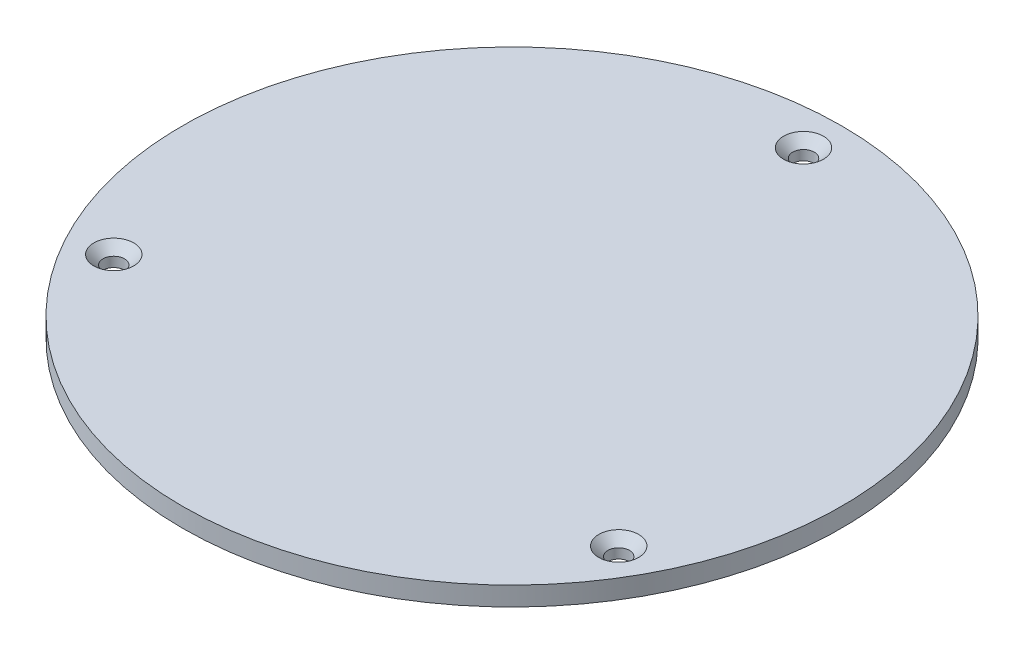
ISO-10303-21;
HEADER;
FILE_DESCRIPTION(('STEP AP214'),'2;1');
FILE_NAME('part.step','',(''),(''),'','','');
FILE_SCHEMA(('AUTOMOTIVE_DESIGN { 1 0 10303 214 1 1 1 1 }'));
ENDSEC;
DATA;
#1=APPLICATION_CONTEXT('core data for automotive mechanical design processes');
#2=APPLICATION_PROTOCOL_DEFINITION('international standard','automotive_design',2000,#1);
#3=PRODUCT_CONTEXT('',#1,'mechanical');
#4=PRODUCT('Part','Part','',(#3));
#5=PRODUCT_RELATED_PRODUCT_CATEGORY('part','',(#4));
#6=PRODUCT_DEFINITION_FORMATION('','',#4);
#7=PRODUCT_DEFINITION_CONTEXT('part definition',#1,'design');
#8=PRODUCT_DEFINITION('design','',#6,#7);
#9=PRODUCT_DEFINITION_SHAPE('','',#8);
#10=(LENGTH_UNIT() NAMED_UNIT(*) SI_UNIT(.MILLI.,.METRE.));
#11=(NAMED_UNIT(*) PLANE_ANGLE_UNIT() SI_UNIT($,.RADIAN.));
#12=(NAMED_UNIT(*) SI_UNIT($,.STERADIAN.) SOLID_ANGLE_UNIT());
#13=UNCERTAINTY_MEASURE_WITH_UNIT(LENGTH_MEASURE(1.E-05),#10,'distance_accuracy_value','');
#14=(GEOMETRIC_REPRESENTATION_CONTEXT(3) GLOBAL_UNCERTAINTY_ASSIGNED_CONTEXT((#13)) GLOBAL_UNIT_ASSIGNED_CONTEXT((#10,
#11,#12)) REPRESENTATION_CONTEXT('',''));
#15=CARTESIAN_POINT('',(0.,0.,0.));
#16=DIRECTION('',(0.,0.,1.));
#17=DIRECTION('',(1.,0.,0.));
#18=AXIS2_PLACEMENT_3D('',#15,#16,#17);
#19=CARTESIAN_POINT('',(0.,3.,0.));
#20=DIRECTION('',(0.,-1.,0.));
#21=DIRECTION('',(0.,0.,-1.));
#22=AXIS2_PLACEMENT_3D('',#19,#20,#21);
#23=CYLINDRICAL_SURFACE('',#22,52.);
#24=CARTESIAN_POINT('',(0.,3.,0.));
#25=DIRECTION('',(0.,1.,0.));
#26=DIRECTION('',(0.,0.,1.));
#27=AXIS2_PLACEMENT_3D('',#24,#25,#26);
#28=CIRCLE('',#27,52.);
#29=CARTESIAN_POINT('',(0.,3.,52.));
#30=VERTEX_POINT('',#29);
#31=EDGE_CURVE('E12',#30,#30,#28,.T.);
#32=ORIENTED_EDGE('',*,*,#31,.F.);
#33=EDGE_LOOP('',(#32));
#34=FACE_BOUND('',#33,.T.);
#35=CARTESIAN_POINT('',(0.,0.,0.));
#36=DIRECTION('',(0.,1.,0.));
#37=DIRECTION('',(0.,0.,1.));
#38=AXIS2_PLACEMENT_3D('',#35,#36,#37);
#39=CIRCLE('',#38,52.);
#40=CARTESIAN_POINT('',(0.,0.,52.));
#41=VERTEX_POINT('',#40);
#42=EDGE_CURVE('E43',#41,#41,#39,.T.);
#43=ORIENTED_EDGE('',*,*,#42,.T.);
#44=EDGE_LOOP('',(#43));
#45=FACE_BOUND('',#44,.T.);
#46=ADVANCED_FACE('F40',(#34,#45),#23,.T.);
#47=CARTESIAN_POINT('',(0.,3.,0.));
#48=DIRECTION('',(0.,1.,0.));
#49=DIRECTION('',(0.,0.,1.));
#50=AXIS2_PLACEMENT_3D('',#47,#48,#49);
#51=PLANE('',#50);
#52=CARTESIAN_POINT('',(-39.8371685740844,3.,22.9999999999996));
#53=DIRECTION('',(0.,1.,0.));
#54=DIRECTION('',(0.,0.,1.));
#55=AXIS2_PLACEMENT_3D('',#52,#53,#54);
#56=CIRCLE('',#55,3.15);
#57=CARTESIAN_POINT('',(-39.8371685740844,3.,26.1499999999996));
#58=VERTEX_POINT('',#57);
#59=EDGE_CURVE('E75',#58,#58,#56,.T.);
#60=ORIENTED_EDGE('',*,*,#59,.F.);
#61=EDGE_LOOP('',(#60));
#62=FACE_BOUND('',#61,.T.);
#63=CARTESIAN_POINT('',(39.8371685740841,3.,23.0000000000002));
#64=DIRECTION('',(0.,1.,0.));
#65=DIRECTION('',(0.,0.,1.));
#66=AXIS2_PLACEMENT_3D('',#63,#64,#65);
#67=CIRCLE('',#66,3.15);
#68=CARTESIAN_POINT('',(39.8371685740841,3.,26.1500000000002));
#69=VERTEX_POINT('',#68);
#70=EDGE_CURVE('E66',#69,#69,#67,.T.);
#71=ORIENTED_EDGE('',*,*,#70,.F.);
#72=EDGE_LOOP('',(#71));
#73=FACE_BOUND('',#72,.T.);
#74=CARTESIAN_POINT('',(0.,3.,-46.));
#75=DIRECTION('',(0.,1.,0.));
#76=DIRECTION('',(0.,0.,1.));
#77=AXIS2_PLACEMENT_3D('',#74,#75,#76);
#78=CIRCLE('',#77,3.15);
#79=CARTESIAN_POINT('',(0.,3.,-42.85));
#80=VERTEX_POINT('',#79);
#81=EDGE_CURVE('E57',#80,#80,#78,.T.);
#82=ORIENTED_EDGE('',*,*,#81,.F.);
#83=EDGE_LOOP('',(#82));
#84=FACE_BOUND('',#83,.T.);
#85=ORIENTED_EDGE('',*,*,#31,.T.);
#86=EDGE_LOOP('',(#85));
#87=FACE_BOUND('',#86,.T.);
#88=ADVANCED_FACE('F81',(#62,#73,#84,#87),#51,.T.);
#89=CARTESIAN_POINT('',(0.,0.,0.));
#90=DIRECTION('',(0.,1.,0.));
#91=DIRECTION('',(0.,0.,1.));
#92=AXIS2_PLACEMENT_3D('',#89,#90,#91);
#93=PLANE('',#92);
#94=CARTESIAN_POINT('',(-39.8371685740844,0.,22.9999999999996));
#95=DIRECTION('',(0.,1.,0.));
#96=DIRECTION('',(0.,0.,1.));
#97=AXIS2_PLACEMENT_3D('',#94,#95,#96);
#98=CIRCLE('',#97,1.7);
#99=CARTESIAN_POINT('',(-39.8371685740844,0.,24.6999999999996));
#100=VERTEX_POINT('',#99);
#101=EDGE_CURVE('E69',#100,#100,#98,.T.);
#102=ORIENTED_EDGE('',*,*,#101,.T.);
#103=EDGE_LOOP('',(#102));
#104=FACE_BOUND('',#103,.T.);
#105=CARTESIAN_POINT('',(39.8371685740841,0.,23.0000000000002));
#106=DIRECTION('',(0.,1.,0.));
#107=DIRECTION('',(0.,0.,1.));
#108=AXIS2_PLACEMENT_3D('',#105,#106,#107);
#109=CIRCLE('',#108,1.7);
#110=CARTESIAN_POINT('',(39.8371685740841,0.,24.7000000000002));
#111=VERTEX_POINT('',#110);
#112=EDGE_CURVE('E60',#111,#111,#109,.T.);
#113=ORIENTED_EDGE('',*,*,#112,.T.);
#114=EDGE_LOOP('',(#113));
#115=FACE_BOUND('',#114,.T.);
#116=CARTESIAN_POINT('',(0.,0.,-46.));
#117=DIRECTION('',(0.,1.,0.));
#118=DIRECTION('',(0.,0.,1.));
#119=AXIS2_PLACEMENT_3D('',#116,#117,#118);
#120=CIRCLE('',#119,1.7);
#121=CARTESIAN_POINT('',(0.,0.,-44.3));
#122=VERTEX_POINT('',#121);
#123=EDGE_CURVE('E50',#122,#122,#120,.T.);
#124=ORIENTED_EDGE('',*,*,#123,.T.);
#125=EDGE_LOOP('',(#124));
#126=FACE_BOUND('',#125,.T.);
#127=ORIENTED_EDGE('',*,*,#42,.F.);
#128=EDGE_LOOP('',(#127));
#129=FACE_BOUND('',#128,.T.);
#130=ADVANCED_FACE('F84',(#104,#115,#126,#129),#93,.F.);
#131=CARTESIAN_POINT('',(0.,3.,-46.));
#132=DIRECTION('',(0.,1.,0.));
#133=DIRECTION('',(0.,0.,1.));
#134=AXIS2_PLACEMENT_3D('',#131,#132,#133);
#135=CYLINDRICAL_SURFACE('',#134,1.7);
#136=ORIENTED_EDGE('',*,*,#123,.F.);
#137=EDGE_LOOP('',(#136));
#138=FACE_BOUND('',#137,.T.);
#139=CARTESIAN_POINT('',(0.,1.55,-46.));
#140=DIRECTION('',(0.,1.,0.));
#141=DIRECTION('',(0.,0.,1.));
#142=AXIS2_PLACEMENT_3D('',#139,#140,#141);
#143=CIRCLE('',#142,1.7);
#144=CARTESIAN_POINT('',(0.,1.55,-44.3));
#145=VERTEX_POINT('',#144);
#146=EDGE_CURVE('E54',#145,#145,#143,.T.);
#147=ORIENTED_EDGE('',*,*,#146,.T.);
#148=EDGE_LOOP('',(#147));
#149=FACE_BOUND('',#148,.T.);
#150=ADVANCED_FACE('F93',(#138,#149),#135,.F.);
#151=CARTESIAN_POINT('',(0.,3.,-46.));
#152=DIRECTION('',(0.,1.,0.));
#153=DIRECTION('',(0.,0.,1.));
#154=AXIS2_PLACEMENT_3D('',#151,#152,#153);
#155=CONICAL_SURFACE('',#154,3.15,0.785398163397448);
#156=ORIENTED_EDGE('',*,*,#146,.F.);
#157=EDGE_LOOP('',(#156));
#158=FACE_BOUND('',#157,.T.);
#159=ORIENTED_EDGE('',*,*,#81,.T.);
#160=EDGE_LOOP('',(#159));
#161=FACE_BOUND('',#160,.T.);
#162=ADVANCED_FACE('F90',(#158,#161),#155,.F.);
#163=CARTESIAN_POINT('',(39.8371685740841,3.,23.0000000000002));
#164=DIRECTION('',(0.,1.,0.));
#165=DIRECTION('',(0.,0.,1.));
#166=AXIS2_PLACEMENT_3D('',#163,#164,#165);
#167=CYLINDRICAL_SURFACE('',#166,1.7);
#168=ORIENTED_EDGE('',*,*,#112,.F.);
#169=EDGE_LOOP('',(#168));
#170=FACE_BOUND('',#169,.T.);
#171=CARTESIAN_POINT('',(39.8371685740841,1.55,23.0000000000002));
#172=DIRECTION('',(0.,1.,0.));
#173=DIRECTION('',(0.,0.,1.));
#174=AXIS2_PLACEMENT_3D('',#171,#172,#173);
#175=CIRCLE('',#174,1.7);
#176=CARTESIAN_POINT('',(39.8371685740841,1.55,24.7000000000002));
#177=VERTEX_POINT('',#176);
#178=EDGE_CURVE('E63',#177,#177,#175,.T.);
#179=ORIENTED_EDGE('',*,*,#178,.T.);
#180=EDGE_LOOP('',(#179));
#181=FACE_BOUND('',#180,.T.);
#182=ADVANCED_FACE('F92',(#170,#181),#167,.F.);
#183=CARTESIAN_POINT('',(39.8371685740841,3.,23.0000000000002));
#184=DIRECTION('',(0.,1.,0.));
#185=DIRECTION('',(0.,0.,1.));
#186=AXIS2_PLACEMENT_3D('',#183,#184,#185);
#187=CONICAL_SURFACE('',#186,3.15,0.785398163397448);
#188=ORIENTED_EDGE('',*,*,#178,.F.);
#189=EDGE_LOOP('',(#188));
#190=FACE_BOUND('',#189,.T.);
#191=ORIENTED_EDGE('',*,*,#70,.T.);
#192=EDGE_LOOP('',(#191));
#193=FACE_BOUND('',#192,.T.);
#194=ADVANCED_FACE('F100',(#190,#193),#187,.F.);
#195=CARTESIAN_POINT('',(-39.8371685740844,3.,22.9999999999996));
#196=DIRECTION('',(0.,1.,0.));
#197=DIRECTION('',(0.,0.,1.));
#198=AXIS2_PLACEMENT_3D('',#195,#196,#197);
#199=CYLINDRICAL_SURFACE('',#198,1.7);
#200=ORIENTED_EDGE('',*,*,#101,.F.);
#201=EDGE_LOOP('',(#200));
#202=FACE_BOUND('',#201,.T.);
#203=CARTESIAN_POINT('',(-39.8371685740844,1.55,22.9999999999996));
#204=DIRECTION('',(0.,1.,0.));
#205=DIRECTION('',(0.,0.,1.));
#206=AXIS2_PLACEMENT_3D('',#203,#204,#205);
#207=CIRCLE('',#206,1.7);
#208=CARTESIAN_POINT('',(-39.8371685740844,1.55,24.6999999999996));
#209=VERTEX_POINT('',#208);
#210=EDGE_CURVE('E72',#209,#209,#207,.T.);
#211=ORIENTED_EDGE('',*,*,#210,.T.);
#212=EDGE_LOOP('',(#211));
#213=FACE_BOUND('',#212,.T.);
#214=ADVANCED_FACE('F128',(#202,#213),#199,.F.);
#215=CARTESIAN_POINT('',(-39.8371685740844,3.,22.9999999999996));
#216=DIRECTION('',(0.,1.,0.));
#217=DIRECTION('',(0.,0.,1.));
#218=AXIS2_PLACEMENT_3D('',#215,#216,#217);
#219=CONICAL_SURFACE('',#218,3.15,0.785398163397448);
#220=ORIENTED_EDGE('',*,*,#210,.F.);
#221=EDGE_LOOP('',(#220));
#222=FACE_BOUND('',#221,.T.);
#223=ORIENTED_EDGE('',*,*,#59,.T.);
#224=EDGE_LOOP('',(#223));
#225=FACE_BOUND('',#224,.T.);
#226=ADVANCED_FACE('F79',(#222,#225),#219,.F.);
#227=CLOSED_SHELL('',(#46,#88,#130,#150,#162,#182,#194,#214,#226));
#228=MANIFOLD_SOLID_BREP('B2',#227);
#229=ADVANCED_BREP_SHAPE_REPRESENTATION('',(#18,#228),#14);
#230=SHAPE_DEFINITION_REPRESENTATION(#9,#229);
ENDSEC;
END-ISO-10303-21;
